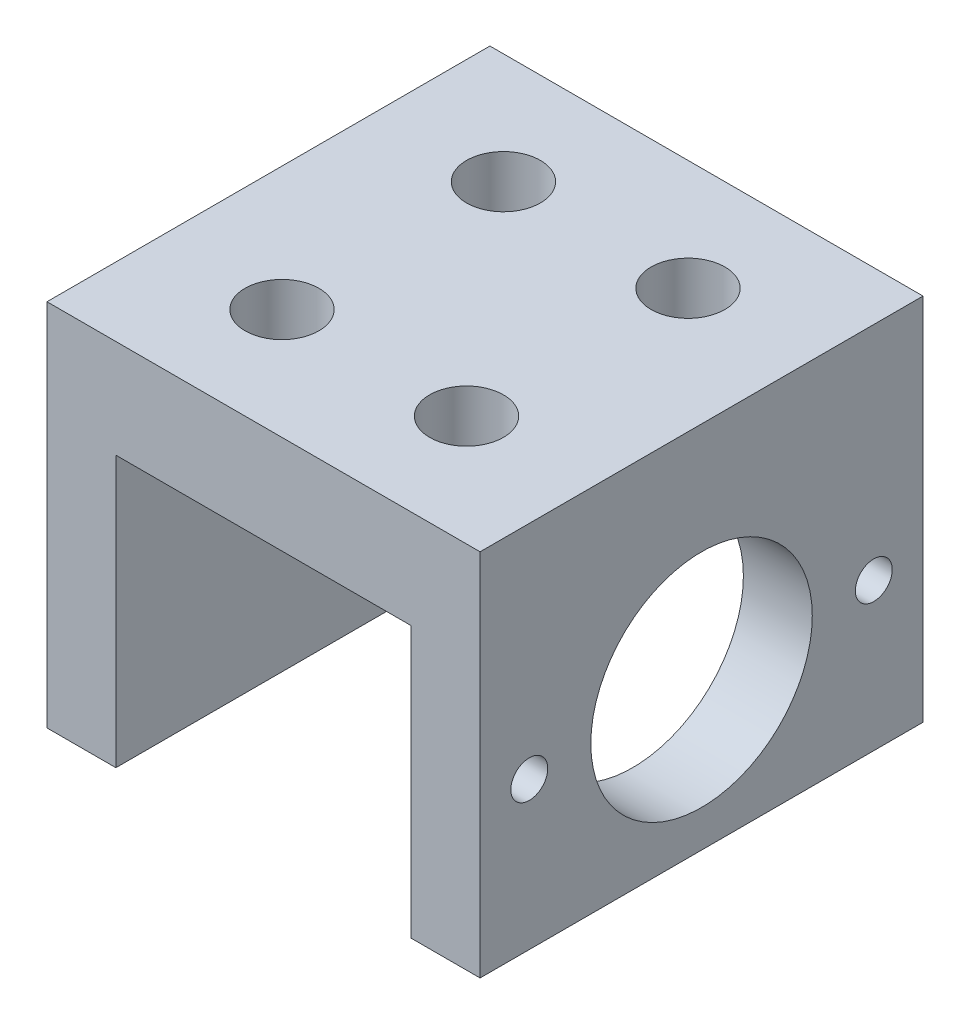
ISO-10303-21;
HEADER;
FILE_DESCRIPTION(('STEP AP214'),'2;1');
FILE_NAME('part.step','',(''),(''),'','','');
FILE_SCHEMA(('AUTOMOTIVE_DESIGN { 1 0 10303 214 1 1 1 1 }'));
ENDSEC;
DATA;
#1=APPLICATION_CONTEXT('core data for automotive mechanical design processes');
#2=APPLICATION_PROTOCOL_DEFINITION('international standard','automotive_design',2000,#1);
#3=PRODUCT_CONTEXT('',#1,'mechanical');
#4=PRODUCT('Part','Part','',(#3));
#5=PRODUCT_RELATED_PRODUCT_CATEGORY('part','',(#4));
#6=PRODUCT_DEFINITION_FORMATION('','',#4);
#7=PRODUCT_DEFINITION_CONTEXT('part definition',#1,'design');
#8=PRODUCT_DEFINITION('design','',#6,#7);
#9=PRODUCT_DEFINITION_SHAPE('','',#8);
#10=(LENGTH_UNIT() NAMED_UNIT(*) SI_UNIT(.MILLI.,.METRE.));
#11=(NAMED_UNIT(*) PLANE_ANGLE_UNIT() SI_UNIT($,.RADIAN.));
#12=(NAMED_UNIT(*) SI_UNIT($,.STERADIAN.) SOLID_ANGLE_UNIT());
#13=UNCERTAINTY_MEASURE_WITH_UNIT(LENGTH_MEASURE(1.E-05),#10,'distance_accuracy_value','');
#14=(GEOMETRIC_REPRESENTATION_CONTEXT(3) GLOBAL_UNCERTAINTY_ASSIGNED_CONTEXT((#13)) GLOBAL_UNIT_ASSIGNED_CONTEXT((#10,
#11,#12)) REPRESENTATION_CONTEXT('',''));
#15=CARTESIAN_POINT('',(0.,0.,0.));
#16=DIRECTION('',(0.,0.,1.));
#17=DIRECTION('',(1.,0.,0.));
#18=AXIS2_PLACEMENT_3D('',#15,#16,#17);
#19=CARTESIAN_POINT('',(0.,-30.,0.));
#20=DIRECTION('',(0.,1.,0.));
#21=DIRECTION('',(0.,0.,1.));
#22=AXIS2_PLACEMENT_3D('',#19,#20,#21);
#23=PLANE('',#22);
#24=DIRECTION('',(1.,0.,0.));
#25=VECTOR('',#24,1.);
#26=CARTESIAN_POINT('',(-17.6,-30.,18.));
#27=LINE('',#26,#25);
#28=CARTESIAN_POINT('',(12.,-30.,18.));
#29=VERTEX_POINT('',#28);
#30=CARTESIAN_POINT('',(17.6,-30.,18.));
#31=VERTEX_POINT('',#30);
#32=EDGE_CURVE('E41',#29,#31,#27,.T.);
#33=ORIENTED_EDGE('',*,*,#32,.F.);
#34=DIRECTION('',(0.,0.,-1.));
#35=VECTOR('',#34,1.);
#36=CARTESIAN_POINT('',(12.,-30.,18.));
#37=LINE('',#36,#35);
#38=CARTESIAN_POINT('',(12.,-30.,-18.));
#39=VERTEX_POINT('',#38);
#40=EDGE_CURVE('E90',#29,#39,#37,.T.);
#41=ORIENTED_EDGE('',*,*,#40,.T.);
#42=DIRECTION('',(-1.,0.,0.));
#43=VECTOR('',#42,1.);
#44=CARTESIAN_POINT('',(17.6,-30.,-18.));
#45=LINE('',#44,#43);
#46=CARTESIAN_POINT('',(17.6,-30.,-18.));
#47=VERTEX_POINT('',#46);
#48=EDGE_CURVE('E112',#47,#39,#45,.T.);
#49=ORIENTED_EDGE('',*,*,#48,.F.);
#50=DIRECTION('',(0.,0.,-1.));
#51=VECTOR('',#50,1.);
#52=CARTESIAN_POINT('',(17.6,-30.,18.));
#53=LINE('',#52,#51);
#54=EDGE_CURVE('E106',#31,#47,#53,.T.);
#55=ORIENTED_EDGE('',*,*,#54,.F.);
#56=EDGE_LOOP('',(#33,#41,#49,#55));
#57=FACE_BOUND('',#56,.T.);
#58=ADVANCED_FACE('F16',(#57),#23,.F.);
#59=CARTESIAN_POINT('',(17.6,-30.,18.));
#60=DIRECTION('',(1.,0.,0.));
#61=DIRECTION('',(0.,0.,-1.));
#62=AXIS2_PLACEMENT_3D('',#59,#60,#61);
#63=PLANE('',#62);
#64=CARTESIAN_POINT('',(17.6,-18.,0.));
#65=DIRECTION('',(1.,0.,0.));
#66=DIRECTION('',(0.,0.,-1.));
#67=AXIS2_PLACEMENT_3D('',#64,#65,#66);
#68=CIRCLE('',#67,9.);
#69=CARTESIAN_POINT('',(17.6,-18.,-9.));
#70=VERTEX_POINT('',#69);
#71=EDGE_CURVE('E211',#70,#70,#68,.T.);
#72=ORIENTED_EDGE('',*,*,#71,.F.);
#73=EDGE_LOOP('',(#72));
#74=FACE_BOUND('',#73,.T.);
#75=CARTESIAN_POINT('',(17.6,-18.,14.));
#76=DIRECTION('',(1.,0.,0.));
#77=DIRECTION('',(0.,0.,-1.));
#78=AXIS2_PLACEMENT_3D('',#75,#76,#77);
#79=CIRCLE('',#78,1.5);
#80=CARTESIAN_POINT('',(17.6,-18.,12.5));
#81=VERTEX_POINT('',#80);
#82=EDGE_CURVE('E158',#81,#81,#79,.T.);
#83=ORIENTED_EDGE('',*,*,#82,.F.);
#84=EDGE_LOOP('',(#83));
#85=FACE_BOUND('',#84,.T.);
#86=CARTESIAN_POINT('',(17.6,-18.,-14.));
#87=DIRECTION('',(1.,0.,0.));
#88=DIRECTION('',(0.,0.,-1.));
#89=AXIS2_PLACEMENT_3D('',#86,#87,#88);
#90=CIRCLE('',#89,1.5);
#91=CARTESIAN_POINT('',(17.6,-18.,-15.5));
#92=VERTEX_POINT('',#91);
#93=EDGE_CURVE('E164',#92,#92,#90,.T.);
#94=ORIENTED_EDGE('',*,*,#93,.F.);
#95=EDGE_LOOP('',(#94));
#96=FACE_BOUND('',#95,.T.);
#97=DIRECTION('',(0.,0.,-1.));
#98=VECTOR('',#97,1.);
#99=CARTESIAN_POINT('',(17.6,0.,18.));
#100=LINE('',#99,#98);
#101=CARTESIAN_POINT('',(17.6,0.,18.));
#102=VERTEX_POINT('',#101);
#103=CARTESIAN_POINT('',(17.6,0.,-18.));
#104=VERTEX_POINT('',#103);
#105=EDGE_CURVE('E116',#102,#104,#100,.T.);
#106=ORIENTED_EDGE('',*,*,#105,.F.);
#107=DIRECTION('',(0.,1.,0.));
#108=VECTOR('',#107,1.);
#109=CARTESIAN_POINT('',(17.6,-30.,18.));
#110=LINE('',#109,#108);
#111=EDGE_CURVE('E10',#31,#102,#110,.T.);
#112=ORIENTED_EDGE('',*,*,#111,.F.);
#113=ORIENTED_EDGE('',*,*,#54,.T.);
#114=DIRECTION('',(0.,1.,0.));
#115=VECTOR('',#114,1.);
#116=CARTESIAN_POINT('',(17.6,-30.,-18.));
#117=LINE('',#116,#115);
#118=EDGE_CURVE('E66',#47,#104,#117,.T.);
#119=ORIENTED_EDGE('',*,*,#118,.T.);
#120=EDGE_LOOP('',(#106,#112,#113,#119));
#121=FACE_BOUND('',#120,.T.);
#122=ADVANCED_FACE('F18',(#74,#85,#96,#121),#63,.T.);
#123=CARTESIAN_POINT('',(-17.6,-30.,18.));
#124=DIRECTION('',(0.,0.,1.));
#125=DIRECTION('',(1.,0.,0.));
#126=AXIS2_PLACEMENT_3D('',#123,#124,#125);
#127=PLANE('',#126);
#128=DIRECTION('',(0.,-1.,0.));
#129=VECTOR('',#128,1.);
#130=CARTESIAN_POINT('',(12.,-8.,18.));
#131=LINE('',#130,#129);
#132=CARTESIAN_POINT('',(12.,-8.,18.));
#133=VERTEX_POINT('',#132);
#134=EDGE_CURVE('E92',#133,#29,#131,.T.);
#135=ORIENTED_EDGE('',*,*,#134,.T.);
#136=ORIENTED_EDGE('',*,*,#32,.T.);
#137=ORIENTED_EDGE('',*,*,#111,.T.);
#138=DIRECTION('',(1.,0.,0.));
#139=VECTOR('',#138,1.);
#140=CARTESIAN_POINT('',(-17.6,0.,18.));
#141=LINE('',#140,#139);
#142=CARTESIAN_POINT('',(-17.6,0.,18.));
#143=VERTEX_POINT('',#142);
#144=EDGE_CURVE('E126',#143,#102,#141,.T.);
#145=ORIENTED_EDGE('',*,*,#144,.F.);
#146=DIRECTION('',(0.,1.,0.));
#147=VECTOR('',#146,1.);
#148=CARTESIAN_POINT('',(-17.6,-30.,18.));
#149=LINE('',#148,#147);
#150=CARTESIAN_POINT('',(-17.6,-30.,18.));
#151=VERTEX_POINT('',#150);
#152=EDGE_CURVE('E25',#151,#143,#149,.T.);
#153=ORIENTED_EDGE('',*,*,#152,.F.);
#154=CARTESIAN_POINT('',(-12.,-30.,18.));
#155=VERTEX_POINT('',#154);
#156=EDGE_CURVE('E107',#151,#155,#27,.T.);
#157=ORIENTED_EDGE('',*,*,#156,.T.);
#158=DIRECTION('',(0.,1.,0.));
#159=VECTOR('',#158,1.);
#160=CARTESIAN_POINT('',(-12.,-30.,18.));
#161=LINE('',#160,#159);
#162=CARTESIAN_POINT('',(-12.,-8.,18.));
#163=VERTEX_POINT('',#162);
#164=EDGE_CURVE('E33',#155,#163,#161,.T.);
#165=ORIENTED_EDGE('',*,*,#164,.T.);
#166=DIRECTION('',(1.,0.,0.));
#167=VECTOR('',#166,1.);
#168=CARTESIAN_POINT('',(-12.,-8.,18.));
#169=LINE('',#168,#167);
#170=EDGE_CURVE('E98',#163,#133,#169,.T.);
#171=ORIENTED_EDGE('',*,*,#170,.T.);
#172=EDGE_LOOP('',(#135,#136,#137,#145,#153,#157,#165,#171));
#173=FACE_BOUND('',#172,.T.);
#174=ADVANCED_FACE('F100',(#173),#127,.T.);
#175=CARTESIAN_POINT('',(-17.6,-30.,-18.));
#176=DIRECTION('',(-1.,0.,0.));
#177=DIRECTION('',(0.,0.,1.));
#178=AXIS2_PLACEMENT_3D('',#175,#176,#177);
#179=PLANE('',#178);
#180=DIRECTION('',(0.,0.,1.));
#181=VECTOR('',#180,1.);
#182=CARTESIAN_POINT('',(-17.6,0.,-18.));
#183=LINE('',#182,#181);
#184=CARTESIAN_POINT('',(-17.6,0.,-18.));
#185=VERTEX_POINT('',#184);
#186=EDGE_CURVE('E123',#185,#143,#183,.T.);
#187=ORIENTED_EDGE('',*,*,#186,.F.);
#188=DIRECTION('',(0.,1.,0.));
#189=VECTOR('',#188,1.);
#190=CARTESIAN_POINT('',(-17.6,-30.,-18.));
#191=LINE('',#190,#189);
#192=CARTESIAN_POINT('',(-17.6,-30.,-18.));
#193=VERTEX_POINT('',#192);
#194=EDGE_CURVE('E130',#193,#185,#191,.T.);
#195=ORIENTED_EDGE('',*,*,#194,.F.);
#196=DIRECTION('',(0.,0.,1.));
#197=VECTOR('',#196,1.);
#198=CARTESIAN_POINT('',(-17.6,-30.,-18.));
#199=LINE('',#198,#197);
#200=EDGE_CURVE('E108',#193,#151,#199,.T.);
#201=ORIENTED_EDGE('',*,*,#200,.T.);
#202=ORIENTED_EDGE('',*,*,#152,.T.);
#203=EDGE_LOOP('',(#187,#195,#201,#202));
#204=FACE_BOUND('',#203,.T.);
#205=ADVANCED_FACE('F192',(#204),#179,.T.);
#206=CARTESIAN_POINT('',(17.6,-30.,-18.));
#207=DIRECTION('',(0.,0.,-1.));
#208=DIRECTION('',(-1.,0.,0.));
#209=AXIS2_PLACEMENT_3D('',#206,#207,#208);
#210=PLANE('',#209);
#211=DIRECTION('',(0.,-1.,0.));
#212=VECTOR('',#211,1.);
#213=CARTESIAN_POINT('',(12.,-8.,-18.));
#214=LINE('',#213,#212);
#215=CARTESIAN_POINT('',(12.,-8.,-18.));
#216=VERTEX_POINT('',#215);
#217=EDGE_CURVE('E95',#216,#39,#214,.T.);
#218=ORIENTED_EDGE('',*,*,#217,.F.);
#219=DIRECTION('',(1.,0.,0.));
#220=VECTOR('',#219,1.);
#221=CARTESIAN_POINT('',(-12.,-8.,-18.));
#222=LINE('',#221,#220);
#223=CARTESIAN_POINT('',(-12.,-8.,-18.));
#224=VERTEX_POINT('',#223);
#225=EDGE_CURVE('E102',#224,#216,#222,.T.);
#226=ORIENTED_EDGE('',*,*,#225,.F.);
#227=DIRECTION('',(0.,1.,0.));
#228=VECTOR('',#227,1.);
#229=CARTESIAN_POINT('',(-12.,-30.,-18.));
#230=LINE('',#229,#228);
#231=CARTESIAN_POINT('',(-12.,-30.,-18.));
#232=VERTEX_POINT('',#231);
#233=EDGE_CURVE('E173',#232,#224,#230,.T.);
#234=ORIENTED_EDGE('',*,*,#233,.F.);
#235=EDGE_CURVE('E182',#232,#193,#45,.T.);
#236=ORIENTED_EDGE('',*,*,#235,.T.);
#237=ORIENTED_EDGE('',*,*,#194,.T.);
#238=DIRECTION('',(-1.,0.,0.));
#239=VECTOR('',#238,1.);
#240=CARTESIAN_POINT('',(17.6,0.,-18.));
#241=LINE('',#240,#239);
#242=EDGE_CURVE('E119',#104,#185,#241,.T.);
#243=ORIENTED_EDGE('',*,*,#242,.F.);
#244=ORIENTED_EDGE('',*,*,#118,.F.);
#245=ORIENTED_EDGE('',*,*,#48,.T.);
#246=EDGE_LOOP('',(#218,#226,#234,#236,#237,#243,#244,#245));
#247=FACE_BOUND('',#246,.T.);
#248=ADVANCED_FACE('F186',(#247),#210,.T.);
#249=ORIENTED_EDGE('',*,*,#235,.F.);
#250=DIRECTION('',(0.,0.,-1.));
#251=VECTOR('',#250,1.);
#252=CARTESIAN_POINT('',(-12.,-30.,18.));
#253=LINE('',#252,#251);
#254=EDGE_CURVE('E97',#155,#232,#253,.T.);
#255=ORIENTED_EDGE('',*,*,#254,.F.);
#256=ORIENTED_EDGE('',*,*,#156,.F.);
#257=ORIENTED_EDGE('',*,*,#200,.F.);
#258=EDGE_LOOP('',(#249,#255,#256,#257));
#259=FACE_BOUND('',#258,.T.);
#260=ADVANCED_FACE('F194',(#259),#23,.F.);
#261=CARTESIAN_POINT('',(0.,0.,0.));
#262=DIRECTION('',(0.,1.,0.));
#263=DIRECTION('',(0.,0.,1.));
#264=AXIS2_PLACEMENT_3D('',#261,#262,#263);
#265=PLANE('',#264);
#266=CARTESIAN_POINT('',(7.5,0.,9.));
#267=DIRECTION('',(0.,1.,0.));
#268=DIRECTION('',(0.,0.,1.));
#269=AXIS2_PLACEMENT_3D('',#266,#267,#268);
#270=CIRCLE('',#269,3.);
#271=CARTESIAN_POINT('',(7.5,0.,12.));
#272=VERTEX_POINT('',#271);
#273=EDGE_CURVE('E149',#272,#272,#270,.T.);
#274=ORIENTED_EDGE('',*,*,#273,.F.);
#275=EDGE_LOOP('',(#274));
#276=FACE_BOUND('',#275,.T.);
#277=CARTESIAN_POINT('',(-7.5,0.,9.));
#278=DIRECTION('',(0.,1.,0.));
#279=DIRECTION('',(0.,0.,1.));
#280=AXIS2_PLACEMENT_3D('',#277,#278,#279);
#281=CIRCLE('',#280,3.);
#282=CARTESIAN_POINT('',(-7.5,0.,12.));
#283=VERTEX_POINT('',#282);
#284=EDGE_CURVE('E139',#283,#283,#281,.T.);
#285=ORIENTED_EDGE('',*,*,#284,.F.);
#286=EDGE_LOOP('',(#285));
#287=FACE_BOUND('',#286,.T.);
#288=CARTESIAN_POINT('',(-7.5,0.,-9.));
#289=DIRECTION('',(0.,1.,0.));
#290=DIRECTION('',(0.,0.,1.));
#291=AXIS2_PLACEMENT_3D('',#288,#289,#290);
#292=CIRCLE('',#291,3.);
#293=CARTESIAN_POINT('',(-7.5,0.,-6.));
#294=VERTEX_POINT('',#293);
#295=EDGE_CURVE('E136',#294,#294,#292,.T.);
#296=ORIENTED_EDGE('',*,*,#295,.F.);
#297=EDGE_LOOP('',(#296));
#298=FACE_BOUND('',#297,.T.);
#299=CARTESIAN_POINT('',(7.5,0.,-9.));
#300=DIRECTION('',(0.,1.,0.));
#301=DIRECTION('',(0.,0.,1.));
#302=AXIS2_PLACEMENT_3D('',#299,#300,#301);
#303=CIRCLE('',#302,3.);
#304=CARTESIAN_POINT('',(7.5,0.,-6.));
#305=VERTEX_POINT('',#304);
#306=EDGE_CURVE('E135',#305,#305,#303,.T.);
#307=ORIENTED_EDGE('',*,*,#306,.F.);
#308=EDGE_LOOP('',(#307));
#309=FACE_BOUND('',#308,.T.);
#310=ORIENTED_EDGE('',*,*,#105,.T.);
#311=ORIENTED_EDGE('',*,*,#242,.T.);
#312=ORIENTED_EDGE('',*,*,#186,.T.);
#313=ORIENTED_EDGE('',*,*,#144,.T.);
#314=EDGE_LOOP('',(#310,#311,#312,#313));
#315=FACE_BOUND('',#314,.T.);
#316=ADVANCED_FACE('F196',(#276,#287,#298,#309,#315),#265,.T.);
#317=CARTESIAN_POINT('',(12.,-8.,18.));
#318=DIRECTION('',(1.,0.,0.));
#319=DIRECTION('',(0.,0.,-1.));
#320=AXIS2_PLACEMENT_3D('',#317,#318,#319);
#321=PLANE('',#320);
#322=CARTESIAN_POINT('',(12.,-18.,0.));
#323=DIRECTION('',(1.,0.,0.));
#324=DIRECTION('',(0.,0.,-1.));
#325=AXIS2_PLACEMENT_3D('',#322,#323,#324);
#326=CIRCLE('',#325,9.);
#327=CARTESIAN_POINT('',(12.,-18.,-9.));
#328=VERTEX_POINT('',#327);
#329=EDGE_CURVE('E333',#328,#328,#326,.T.);
#330=ORIENTED_EDGE('',*,*,#329,.T.);
#331=EDGE_LOOP('',(#330));
#332=FACE_BOUND('',#331,.T.);
#333=CARTESIAN_POINT('',(12.,-18.,14.));
#334=DIRECTION('',(1.,0.,0.));
#335=DIRECTION('',(0.,0.,-1.));
#336=AXIS2_PLACEMENT_3D('',#333,#334,#335);
#337=CIRCLE('',#336,1.5);
#338=CARTESIAN_POINT('',(12.,-18.,12.5));
#339=VERTEX_POINT('',#338);
#340=EDGE_CURVE('E161',#339,#339,#337,.T.);
#341=ORIENTED_EDGE('',*,*,#340,.T.);
#342=EDGE_LOOP('',(#341));
#343=FACE_BOUND('',#342,.T.);
#344=CARTESIAN_POINT('',(12.,-18.,-14.));
#345=DIRECTION('',(1.,0.,0.));
#346=DIRECTION('',(0.,0.,-1.));
#347=AXIS2_PLACEMENT_3D('',#344,#345,#346);
#348=CIRCLE('',#347,1.5);
#349=CARTESIAN_POINT('',(12.,-18.,-15.5));
#350=VERTEX_POINT('',#349);
#351=EDGE_CURVE('E167',#350,#350,#348,.T.);
#352=ORIENTED_EDGE('',*,*,#351,.T.);
#353=EDGE_LOOP('',(#352));
#354=FACE_BOUND('',#353,.T.);
#355=ORIENTED_EDGE('',*,*,#217,.T.);
#356=ORIENTED_EDGE('',*,*,#40,.F.);
#357=ORIENTED_EDGE('',*,*,#134,.F.);
#358=DIRECTION('',(0.,0.,-1.));
#359=VECTOR('',#358,1.);
#360=CARTESIAN_POINT('',(12.,-8.,18.));
#361=LINE('',#360,#359);
#362=EDGE_CURVE('E120',#133,#216,#361,.T.);
#363=ORIENTED_EDGE('',*,*,#362,.T.);
#364=EDGE_LOOP('',(#355,#356,#357,#363));
#365=FACE_BOUND('',#364,.T.);
#366=ADVANCED_FACE('F91',(#332,#343,#354,#365),#321,.F.);
#367=CARTESIAN_POINT('',(-12.,-8.,18.));
#368=DIRECTION('',(0.,1.,0.));
#369=DIRECTION('',(0.,0.,1.));
#370=AXIS2_PLACEMENT_3D('',#367,#368,#369);
#371=PLANE('',#370);
#372=CARTESIAN_POINT('',(7.5,-8.,9.));
#373=DIRECTION('',(0.,1.,0.));
#374=DIRECTION('',(0.,0.,1.));
#375=AXIS2_PLACEMENT_3D('',#372,#373,#374);
#376=CIRCLE('',#375,3.);
#377=CARTESIAN_POINT('',(7.5,-8.,12.));
#378=VERTEX_POINT('',#377);
#379=EDGE_CURVE('E20',#378,#378,#376,.T.);
#380=ORIENTED_EDGE('',*,*,#379,.T.);
#381=EDGE_LOOP('',(#380));
#382=FACE_BOUND('',#381,.T.);
#383=CARTESIAN_POINT('',(-7.5,-8.,9.));
#384=DIRECTION('',(0.,1.,0.));
#385=DIRECTION('',(0.,0.,1.));
#386=AXIS2_PLACEMENT_3D('',#383,#384,#385);
#387=CIRCLE('',#386,3.);
#388=CARTESIAN_POINT('',(-7.5,-8.,12.));
#389=VERTEX_POINT('',#388);
#390=EDGE_CURVE('E137',#389,#389,#387,.T.);
#391=ORIENTED_EDGE('',*,*,#390,.T.);
#392=EDGE_LOOP('',(#391));
#393=FACE_BOUND('',#392,.T.);
#394=CARTESIAN_POINT('',(-7.5,-8.,-9.));
#395=DIRECTION('',(0.,1.,0.));
#396=DIRECTION('',(0.,0.,1.));
#397=AXIS2_PLACEMENT_3D('',#394,#395,#396);
#398=CIRCLE('',#397,3.);
#399=CARTESIAN_POINT('',(-7.5,-8.,-6.));
#400=VERTEX_POINT('',#399);
#401=EDGE_CURVE('E133',#400,#400,#398,.T.);
#402=ORIENTED_EDGE('',*,*,#401,.T.);
#403=EDGE_LOOP('',(#402));
#404=FACE_BOUND('',#403,.T.);
#405=CARTESIAN_POINT('',(7.5,-8.,-9.));
#406=DIRECTION('',(0.,1.,0.));
#407=DIRECTION('',(0.,0.,1.));
#408=AXIS2_PLACEMENT_3D('',#405,#406,#407);
#409=CIRCLE('',#408,3.);
#410=CARTESIAN_POINT('',(7.5,-8.,-6.));
#411=VERTEX_POINT('',#410);
#412=EDGE_CURVE('E155',#411,#411,#409,.T.);
#413=ORIENTED_EDGE('',*,*,#412,.T.);
#414=EDGE_LOOP('',(#413));
#415=FACE_BOUND('',#414,.T.);
#416=ORIENTED_EDGE('',*,*,#225,.T.);
#417=ORIENTED_EDGE('',*,*,#362,.F.);
#418=ORIENTED_EDGE('',*,*,#170,.F.);
#419=DIRECTION('',(0.,0.,-1.));
#420=VECTOR('',#419,1.);
#421=CARTESIAN_POINT('',(-12.,-8.,18.));
#422=LINE('',#421,#420);
#423=EDGE_CURVE('E179',#163,#224,#422,.T.);
#424=ORIENTED_EDGE('',*,*,#423,.T.);
#425=EDGE_LOOP('',(#416,#417,#418,#424));
#426=FACE_BOUND('',#425,.T.);
#427=ADVANCED_FACE('F230',(#382,#393,#404,#415,#426),#371,.F.);
#428=CARTESIAN_POINT('',(-12.,-30.,18.));
#429=DIRECTION('',(-1.,0.,0.));
#430=DIRECTION('',(0.,0.,1.));
#431=AXIS2_PLACEMENT_3D('',#428,#429,#430);
#432=PLANE('',#431);
#433=ORIENTED_EDGE('',*,*,#233,.T.);
#434=ORIENTED_EDGE('',*,*,#423,.F.);
#435=ORIENTED_EDGE('',*,*,#164,.F.);
#436=ORIENTED_EDGE('',*,*,#254,.T.);
#437=EDGE_LOOP('',(#433,#434,#435,#436));
#438=FACE_BOUND('',#437,.T.);
#439=ADVANCED_FACE('F219',(#438),#432,.F.);
#440=CARTESIAN_POINT('',(17.6,-18.,-14.));
#441=DIRECTION('',(1.,0.,0.));
#442=DIRECTION('',(0.,0.,-1.));
#443=AXIS2_PLACEMENT_3D('',#440,#441,#442);
#444=CYLINDRICAL_SURFACE('',#443,1.5);
#445=ORIENTED_EDGE('',*,*,#351,.F.);
#446=EDGE_LOOP('',(#445));
#447=FACE_BOUND('',#446,.T.);
#448=ORIENTED_EDGE('',*,*,#93,.T.);
#449=EDGE_LOOP('',(#448));
#450=FACE_BOUND('',#449,.T.);
#451=ADVANCED_FACE('F216',(#447,#450),#444,.F.);
#452=CARTESIAN_POINT('',(17.6,-18.,14.));
#453=DIRECTION('',(1.,0.,0.));
#454=DIRECTION('',(0.,0.,-1.));
#455=AXIS2_PLACEMENT_3D('',#452,#453,#454);
#456=CYLINDRICAL_SURFACE('',#455,1.5);
#457=ORIENTED_EDGE('',*,*,#340,.F.);
#458=EDGE_LOOP('',(#457));
#459=FACE_BOUND('',#458,.T.);
#460=ORIENTED_EDGE('',*,*,#82,.T.);
#461=EDGE_LOOP('',(#460));
#462=FACE_BOUND('',#461,.T.);
#463=ADVANCED_FACE('F218',(#459,#462),#456,.F.);
#464=CARTESIAN_POINT('',(7.5,0.,-9.));
#465=DIRECTION('',(0.,1.,0.));
#466=DIRECTION('',(0.,0.,1.));
#467=AXIS2_PLACEMENT_3D('',#464,#465,#466);
#468=CYLINDRICAL_SURFACE('',#467,3.);
#469=ORIENTED_EDGE('',*,*,#306,.T.);
#470=EDGE_LOOP('',(#469));
#471=FACE_BOUND('',#470,.T.);
#472=ORIENTED_EDGE('',*,*,#412,.F.);
#473=EDGE_LOOP('',(#472));
#474=FACE_BOUND('',#473,.T.);
#475=ADVANCED_FACE('F227',(#471,#474),#468,.F.);
#476=CARTESIAN_POINT('',(-7.5,0.,-9.));
#477=DIRECTION('',(0.,1.,0.));
#478=DIRECTION('',(0.,0.,1.));
#479=AXIS2_PLACEMENT_3D('',#476,#477,#478);
#480=CYLINDRICAL_SURFACE('',#479,3.);
#481=ORIENTED_EDGE('',*,*,#295,.T.);
#482=EDGE_LOOP('',(#481));
#483=FACE_BOUND('',#482,.T.);
#484=ORIENTED_EDGE('',*,*,#401,.F.);
#485=EDGE_LOOP('',(#484));
#486=FACE_BOUND('',#485,.T.);
#487=ADVANCED_FACE('F298',(#483,#486),#480,.F.);
#488=CARTESIAN_POINT('',(-7.5,0.,9.));
#489=DIRECTION('',(0.,1.,0.));
#490=DIRECTION('',(0.,0.,1.));
#491=AXIS2_PLACEMENT_3D('',#488,#489,#490);
#492=CYLINDRICAL_SURFACE('',#491,3.);
#493=ORIENTED_EDGE('',*,*,#284,.T.);
#494=EDGE_LOOP('',(#493));
#495=FACE_BOUND('',#494,.T.);
#496=ORIENTED_EDGE('',*,*,#390,.F.);
#497=EDGE_LOOP('',(#496));
#498=FACE_BOUND('',#497,.T.);
#499=ADVANCED_FACE('F305',(#495,#498),#492,.F.);
#500=CARTESIAN_POINT('',(7.5,0.,9.));
#501=DIRECTION('',(0.,1.,0.));
#502=DIRECTION('',(0.,0.,1.));
#503=AXIS2_PLACEMENT_3D('',#500,#501,#502);
#504=CYLINDRICAL_SURFACE('',#503,3.);
#505=ORIENTED_EDGE('',*,*,#273,.T.);
#506=EDGE_LOOP('',(#505));
#507=FACE_BOUND('',#506,.T.);
#508=ORIENTED_EDGE('',*,*,#379,.F.);
#509=EDGE_LOOP('',(#508));
#510=FACE_BOUND('',#509,.T.);
#511=ADVANCED_FACE('F313',(#507,#510),#504,.F.);
#512=CARTESIAN_POINT('',(17.6,-18.,0.));
#513=DIRECTION('',(1.,0.,0.));
#514=DIRECTION('',(0.,0.,-1.));
#515=AXIS2_PLACEMENT_3D('',#512,#513,#514);
#516=CYLINDRICAL_SURFACE('',#515,9.);
#517=ORIENTED_EDGE('',*,*,#329,.F.);
#518=EDGE_LOOP('',(#517));
#519=FACE_BOUND('',#518,.T.);
#520=ORIENTED_EDGE('',*,*,#71,.T.);
#521=EDGE_LOOP('',(#520));
#522=FACE_BOUND('',#521,.T.);
#523=ADVANCED_FACE('F320',(#519,#522),#516,.F.);
#524=CLOSED_SHELL('',(#58,#122,#174,#205,#248,#260,#316,#366,#427,#439,#451,#463,#475,#487,#499,
#511,#523));
#525=MANIFOLD_SOLID_BREP('B1',#524);
#526=ADVANCED_BREP_SHAPE_REPRESENTATION('',(#18,#525),#14);
#527=SHAPE_DEFINITION_REPRESENTATION(#9,#526);
ENDSEC;
END-ISO-10303-21;
